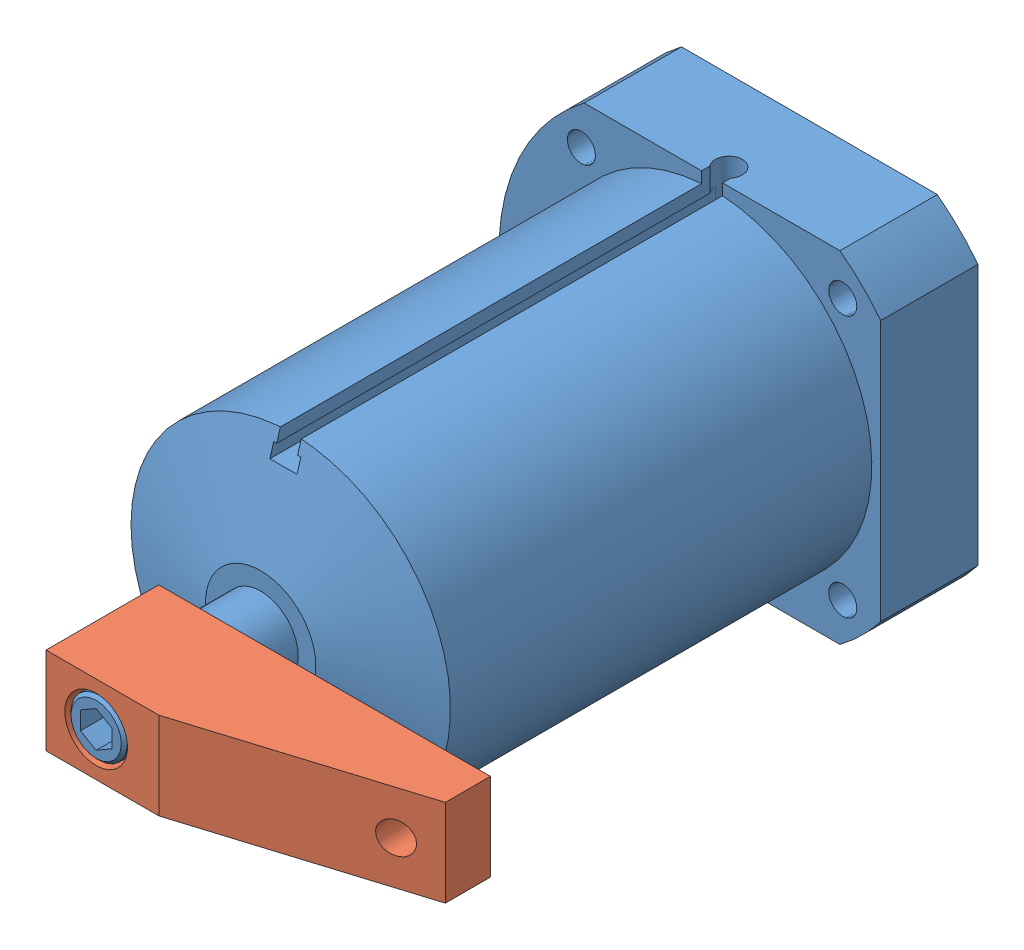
SolidWorks assembly ilcp1524700.sldasm, configuration Default (file format 4400). Lengths in mm.
Overall size (125.25 86.36 180.59).
2 component instances, 2 part files, 3 mates.
Components (placement in the parent):
- ilcp1524700-1: ilcp1524700.sldprt [Default] at origin size (96.67 86.36 180.59)
- ilc91502503-2: ilc91502503.SLDPRT [Default] at (-12.7 -11.049 152.019) x (0 1 0) z (1 0 0) size (22.1 28.57 83.97)
Mates (geometry in assembly coordinates):
- Coincident1: coincident aligned: circle of ilcp1524700-1; plane of ilc91502503-2 through (71.2724 -11.049 152.019) normal (0 0 -1)
- Concentric1: concentric aligned: cone of ilcp1524700-1 through (0 0 152.019) axis (0 0 1); cone of ilc91502503-2 through (0 0 165.5064) axis (0 0 1)
- Parallel1: parallel aligned: plane of ilcp1524700-1 through (42.6974 33.0187 138.938) normal (1 0 0); plane of ilc91502503-2 through (71.2724 -11.049 180.594) normal (1 0 0)
